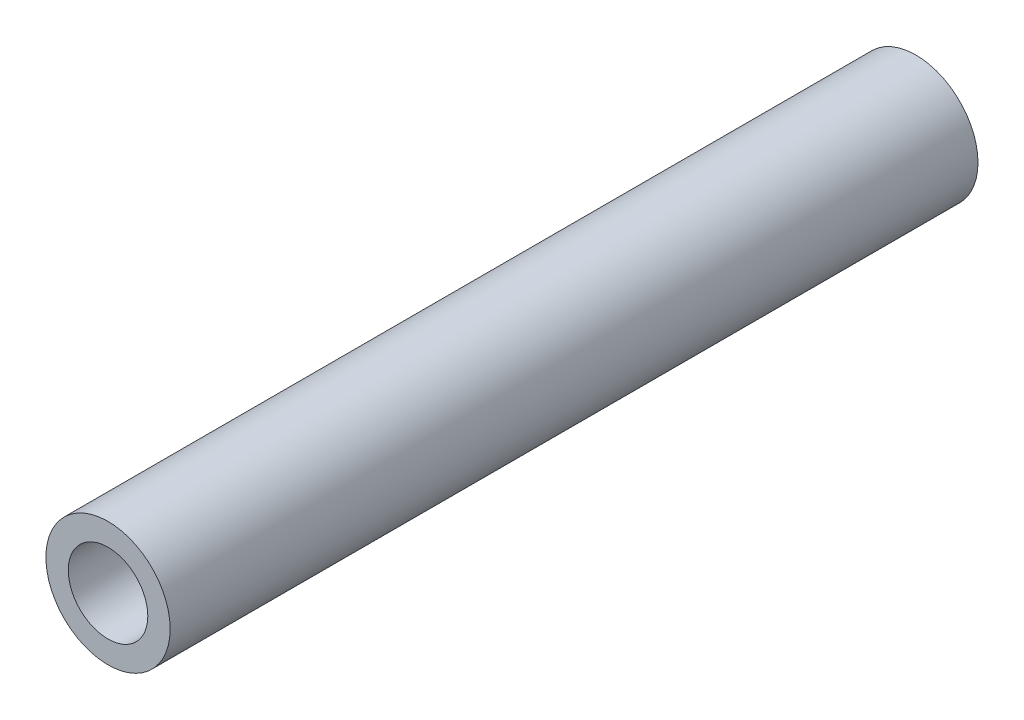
from build123d import *

# Parameters (mm, degrees)
ESQUISSE1_R             = 2.5
BOSS_EXTRU_1_DEPTH      = 32.5
ESQUISSE2_R             = 1.25
ENL_V_MAT_EXTRU_1_DEPTH = 8
ESQUISSE3_R             = 1.6
ENL_V_MAT_EXTRU_2_DEPTH = 8


with BuildPart() as part:
    # Esquisse1 → Boss.-Extru.1 (new body)
    with BuildSketch(Plane.XY):
        Circle(ESQUISSE1_R)
    extrude(amount=BOSS_EXTRU_1_DEPTH)

    # Esquisse2 → Enl_v. mat.-Extru.1 (cut)
    with BuildSketch(Plane(origin=(0, 0, 0), x_dir=(-1, 0, 0), z_dir=(0, 0, -1))):
        Circle(ESQUISSE2_R)
    extrude(amount=-ENL_V_MAT_EXTRU_1_DEPTH, mode=Mode.SUBTRACT)

    # Esquisse3 → Enl_v. mat.-Extru.2 (cut)
    with BuildSketch(Plane.XY.offset(32.5)):
        Circle(ESQUISSE3_R)
    extrude(amount=-ENL_V_MAT_EXTRU_2_DEPTH, mode=Mode.SUBTRACT)


solid = part.part
